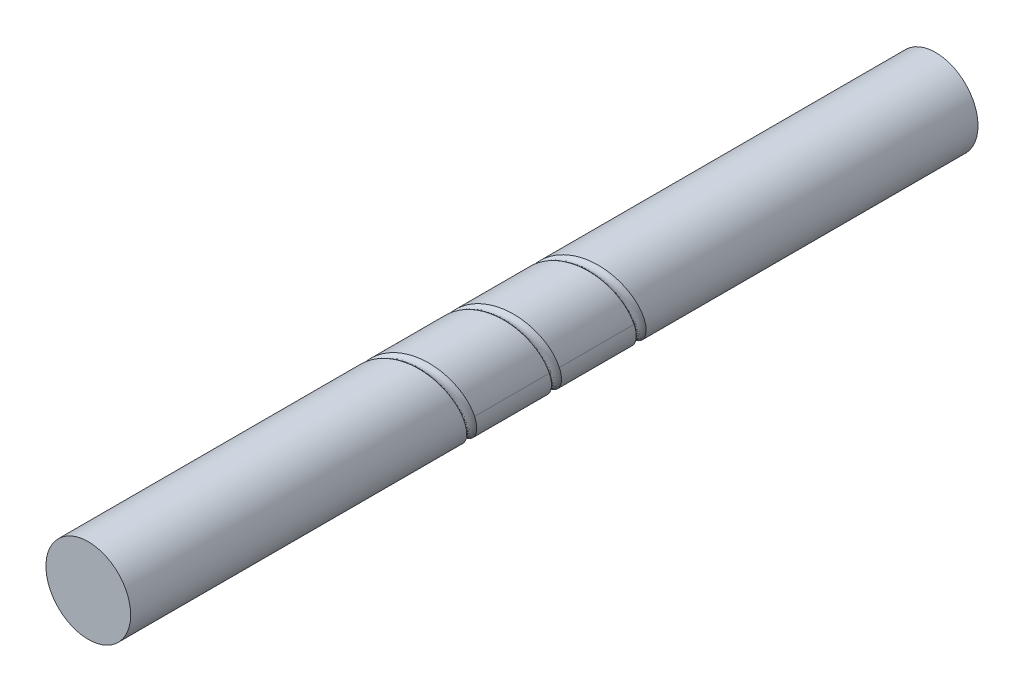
from build123d import *

# Parameters (mm, degrees)
SKETCH1_R              = 25
BOSS_EXTRUDE1_DEPTH    = 500
CUT_SWEEP1_PITCH       = 50
CUT_SWEEP1_HEIGHT      = 150
CUT_SWEEP1_RADIUS      = 27.646
CUT_SWEEP1_START_ANGLE = -180
SKETCH3_R              = 3.969


with BuildPart() as part:
    # Sketch1 → Boss-Extrude1 (new body)
    with BuildSketch(Plane.XY):
        Circle(SKETCH1_R)
    extrude(amount=BOSS_EXTRUDE1_DEPTH)

    # Cut-Sweep1: sweep along a helix
    with BuildLine() as cut_sweep1_path:
        add(Helix(CUT_SWEEP1_PITCH, CUT_SWEEP1_HEIGHT, CUT_SWEEP1_RADIUS, center=(0, 0, 175), direction=(0, 0, 1), mode=Mode.PRIVATE).rotate(Axis((0, 0, 175), (0, 0, 1)), CUT_SWEEP1_START_ANGLE))
    # Sketch3 → Cut-Sweep1 (sweep, cut)
    with BuildSketch(Plane(origin=(0, 0, 0), x_dir=(1, 0, 0), z_dir=(0, 1, 0))):
        with Locations((-27.646, -175)):
            Circle(SKETCH3_R)
    sweep(path=cut_sweep1_path.line, is_frenet=True, mode=Mode.SUBTRACT)


solid = part.part
